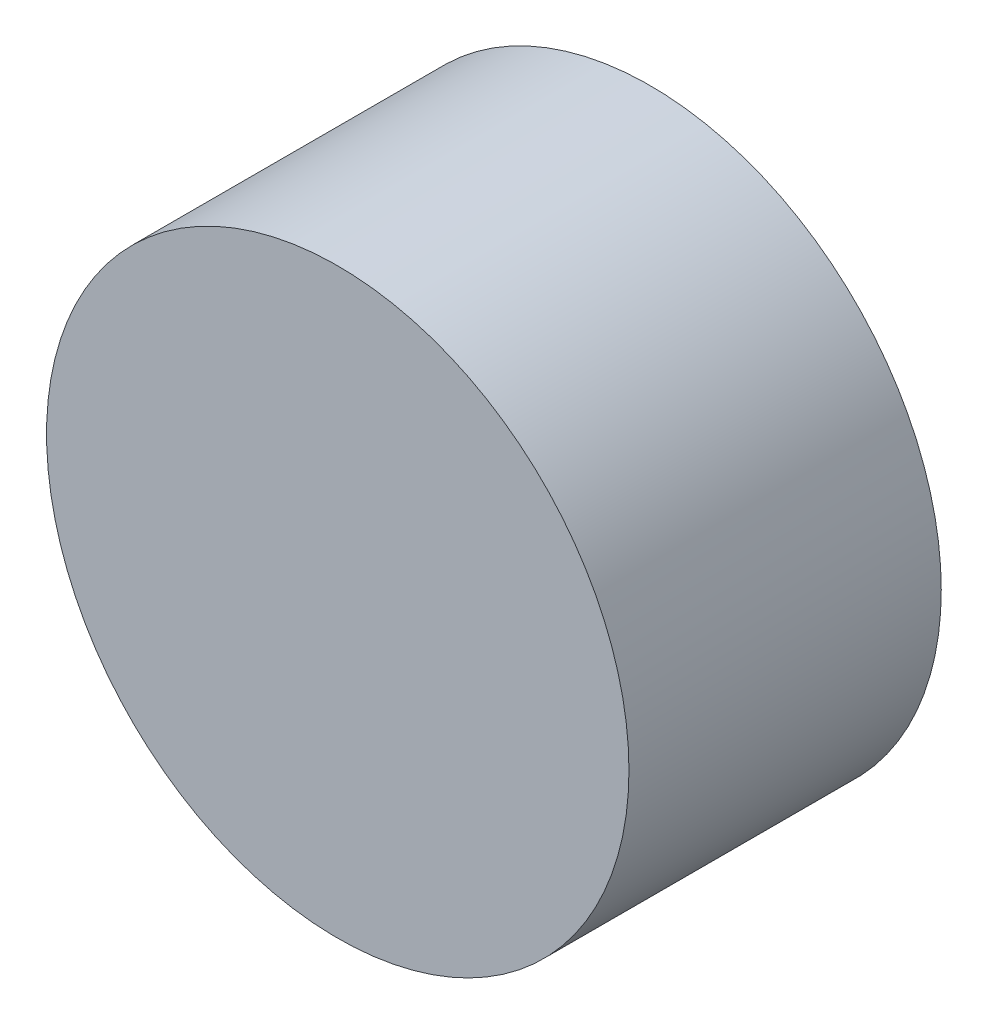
ISO-10303-21;
HEADER;
FILE_DESCRIPTION(('STEP AP214'),'2;1');
FILE_NAME('part.step','',(''),(''),'','','');
FILE_SCHEMA(('AUTOMOTIVE_DESIGN { 1 0 10303 214 1 1 1 1 }'));
ENDSEC;
DATA;
#1=APPLICATION_CONTEXT('core data for automotive mechanical design processes');
#2=APPLICATION_PROTOCOL_DEFINITION('international standard','automotive_design',2000,#1);
#3=PRODUCT_CONTEXT('',#1,'mechanical');
#4=PRODUCT('Part','Part','',(#3));
#5=PRODUCT_RELATED_PRODUCT_CATEGORY('part','',(#4));
#6=PRODUCT_DEFINITION_FORMATION('','',#4);
#7=PRODUCT_DEFINITION_CONTEXT('part definition',#1,'design');
#8=PRODUCT_DEFINITION('design','',#6,#7);
#9=PRODUCT_DEFINITION_SHAPE('','',#8);
#10=(LENGTH_UNIT() NAMED_UNIT(*) SI_UNIT(.MILLI.,.METRE.));
#11=(NAMED_UNIT(*) PLANE_ANGLE_UNIT() SI_UNIT($,.RADIAN.));
#12=(NAMED_UNIT(*) SI_UNIT($,.STERADIAN.) SOLID_ANGLE_UNIT());
#13=UNCERTAINTY_MEASURE_WITH_UNIT(LENGTH_MEASURE(1.E-05),#10,'distance_accuracy_value','');
#14=(GEOMETRIC_REPRESENTATION_CONTEXT(3) GLOBAL_UNCERTAINTY_ASSIGNED_CONTEXT((#13)) GLOBAL_UNIT_ASSIGNED_CONTEXT((#10,
#11,#12)) REPRESENTATION_CONTEXT('',''));
#15=CARTESIAN_POINT('',(0.,0.,0.));
#16=DIRECTION('',(0.,0.,1.));
#17=DIRECTION('',(1.,0.,0.));
#18=AXIS2_PLACEMENT_3D('',#15,#16,#17);
#19=CARTESIAN_POINT('',(0.,0.,50.8));
#20=DIRECTION('',(0.,0.,-1.));
#21=DIRECTION('',(-1.,0.,0.));
#22=AXIS2_PLACEMENT_3D('',#19,#20,#21);
#23=CYLINDRICAL_SURFACE('',#22,47.3681583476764);
#24=CARTESIAN_POINT('',(0.,0.,50.8));
#25=DIRECTION('',(0.,0.,1.));
#26=DIRECTION('',(1.,0.,0.));
#27=AXIS2_PLACEMENT_3D('',#24,#25,#26);
#28=CIRCLE('',#27,47.3681583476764);
#29=CARTESIAN_POINT('',(47.3681583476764,0.,50.8));
#30=VERTEX_POINT('',#29);
#31=EDGE_CURVE('E10',#30,#30,#28,.T.);
#32=ORIENTED_EDGE('',*,*,#31,.F.);
#33=EDGE_LOOP('',(#32));
#34=FACE_BOUND('',#33,.T.);
#35=CARTESIAN_POINT('',(0.,0.,0.));
#36=DIRECTION('',(0.,0.,1.));
#37=DIRECTION('',(1.,0.,0.));
#38=AXIS2_PLACEMENT_3D('',#35,#36,#37);
#39=CIRCLE('',#38,47.3681583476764);
#40=CARTESIAN_POINT('',(47.3681583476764,0.,0.));
#41=VERTEX_POINT('',#40);
#42=EDGE_CURVE('E30',#41,#41,#39,.T.);
#43=ORIENTED_EDGE('',*,*,#42,.T.);
#44=EDGE_LOOP('',(#43));
#45=FACE_BOUND('',#44,.T.);
#46=ADVANCED_FACE('F24',(#34,#45),#23,.T.);
#47=CARTESIAN_POINT('',(0.,0.,50.8));
#48=DIRECTION('',(0.,0.,1.));
#49=DIRECTION('',(1.,0.,0.));
#50=AXIS2_PLACEMENT_3D('',#47,#48,#49);
#51=PLANE('',#50);
#52=ORIENTED_EDGE('',*,*,#31,.T.);
#53=EDGE_LOOP('',(#52));
#54=FACE_BOUND('',#53,.T.);
#55=ADVANCED_FACE('F39',(#54),#51,.T.);
#56=CARTESIAN_POINT('',(0.,0.,0.));
#57=DIRECTION('',(0.,0.,1.));
#58=DIRECTION('',(1.,0.,0.));
#59=AXIS2_PLACEMENT_3D('',#56,#57,#58);
#60=PLANE('',#59);
#61=ORIENTED_EDGE('',*,*,#42,.F.);
#62=EDGE_LOOP('',(#61));
#63=FACE_BOUND('',#62,.T.);
#64=ADVANCED_FACE('F37',(#63),#60,.F.);
#65=CLOSED_SHELL('',(#46,#55,#64));
#66=MANIFOLD_SOLID_BREP('B2',#65);
#67=ADVANCED_BREP_SHAPE_REPRESENTATION('',(#18,#66),#14);
#68=SHAPE_DEFINITION_REPRESENTATION(#9,#67);
ENDSEC;
END-ISO-10303-21;
